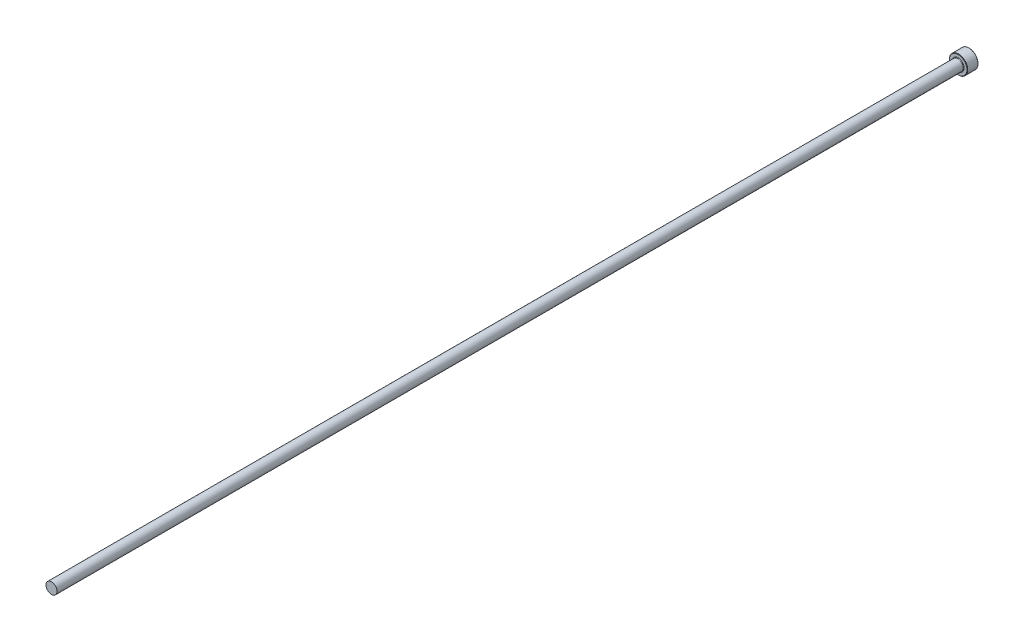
from build123d import *

# Parameters (mm, degrees)
CHAMFER1_SIZE = 0.2


with BuildPart() as part:
    # Sketch1 → Revolve1 (revolve)
    with BuildSketch(Plane(origin=(0, 0, 0), x_dir=(0, 0, -1), z_dir=(1, 0, 0)), mode=Mode.PRIVATE) as revolve1_sk:
        with BuildLine():
            Line((0, 0), (0, 5))
            Line((0, 5), (-6, 5))
            Line((-6, 5), (-6, 3.3))
            ThreePointArc((-6, 3.3), (-6.087867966, 3.087867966), (-6.3, 3))
            Line((-6.3, 3), (-500, 3))
            Line((-500, 3), (-500, 0))
            Line((-500, 0), (0, 0))
        make_face()
    revolve(revolve1_sk.sketch.rotate(Axis((0, 0, 109.05062828), (0, 0, -1)), 90), axis=Axis((0, 0, 109.05062828), (0, 0, -1)))

    # Chamfer1
    chamfer1_edges = [part.edges().sort_by_distance(p)[0] for p in [
        (-5, 0, 0),
        (-5, 0, 6),
    ]]
    chamfer(chamfer1_edges, length=CHAMFER1_SIZE)


solid = part.part
